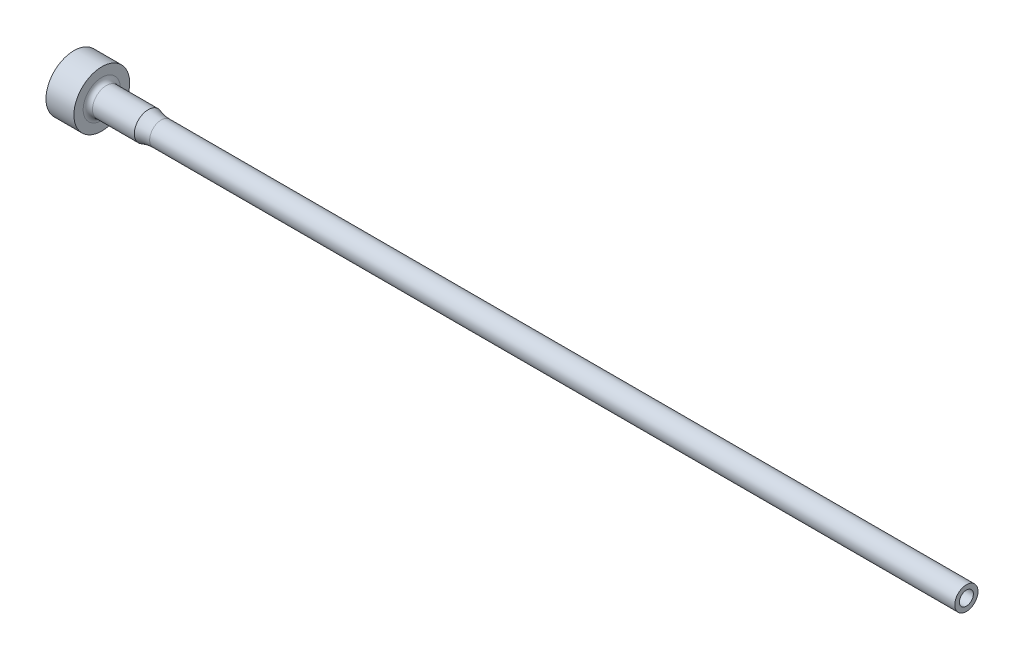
from build123d import *


with BuildPart() as part:
    # Sketch1 → Revolve1 (revolve)
    with BuildSketch(Plane.XY, mode=Mode.PRIVATE) as revolve1_sk:
        with BuildLine():
            Line((-5.1e-08, 4.7625), (-5.1e-08, 2.079625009))
            Line((-5.1e-08, 2.079625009), (0.761999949, 1.317625))
            Line((0.761999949, 1.317625), (107.876676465, 1.317625))
            Line((107.876676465, 1.317625), (107.949999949, 1.190625))
            Line((107.949999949, 1.190625), (152.399999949, 1.190625))
            Line((152.399999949, 1.190625), (152.399999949, 1.98501))
            Line((152.399999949, 1.98501), (14.925042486, 1.98501))
            ThreePointArc((14.925042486, 1.98501), (13.794457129, 2.08646803), (12.699999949, 2.3876))
            Line((12.699999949, 2.3876), (5.556249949, 2.3876))
            ThreePointArc((5.556249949, 2.3876), (4.994983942, 2.620083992), (4.762499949, 3.18135))
            Line((4.762499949, 3.18135), (4.762499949, 4.7625))
            Line((4.762499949, 4.7625), (-5.1e-08, 4.7625))
        make_face()
    revolve(revolve1_sk.sketch.rotate(Axis((101.599999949, 0, 0), (-1, 0, 0)), 270), axis=Axis((101.599999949, 0, 0), (-1, 0, 0)))


solid = part.part
